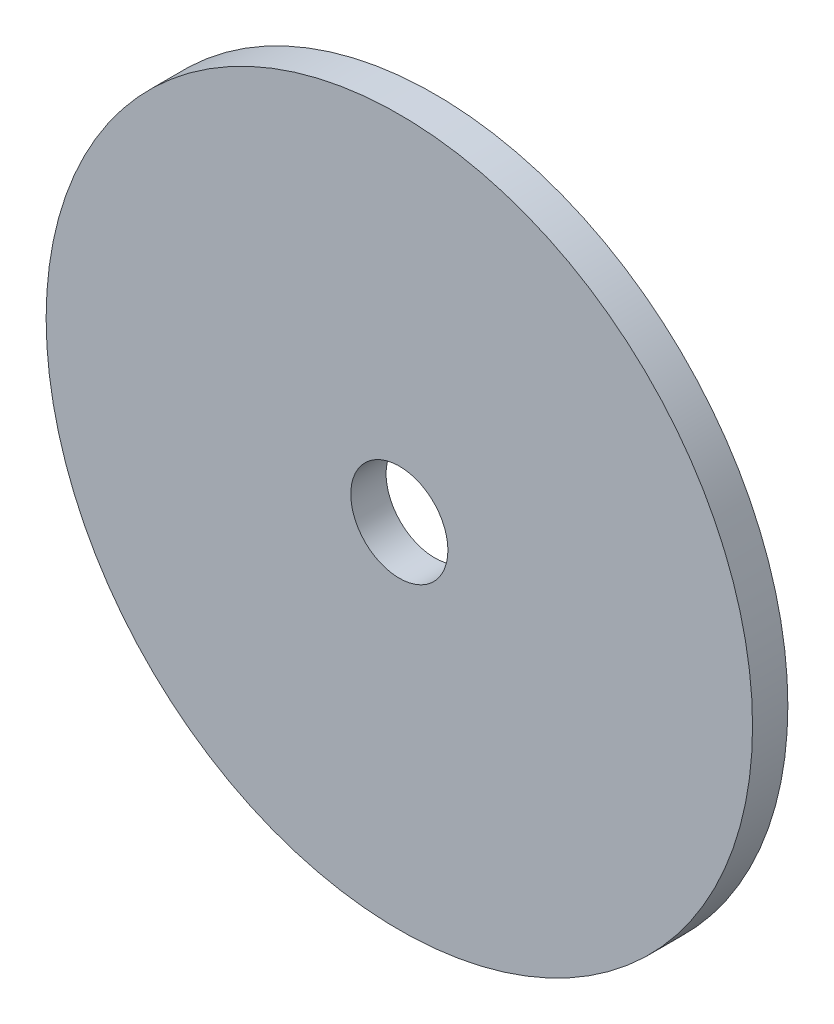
ISO-10303-21;
HEADER;
FILE_DESCRIPTION(('STEP AP214'),'2;1');
FILE_NAME('part.step','',(''),(''),'','','');
FILE_SCHEMA(('AUTOMOTIVE_DESIGN { 1 0 10303 214 1 1 1 1 }'));
ENDSEC;
DATA;
#1=APPLICATION_CONTEXT('core data for automotive mechanical design processes');
#2=APPLICATION_PROTOCOL_DEFINITION('international standard','automotive_design',2000,#1);
#3=PRODUCT_CONTEXT('',#1,'mechanical');
#4=PRODUCT('Part','Part','',(#3));
#5=PRODUCT_RELATED_PRODUCT_CATEGORY('part','',(#4));
#6=PRODUCT_DEFINITION_FORMATION('','',#4);
#7=PRODUCT_DEFINITION_CONTEXT('part definition',#1,'design');
#8=PRODUCT_DEFINITION('design','',#6,#7);
#9=PRODUCT_DEFINITION_SHAPE('','',#8);
#10=(LENGTH_UNIT() NAMED_UNIT(*) SI_UNIT(.MILLI.,.METRE.));
#11=(NAMED_UNIT(*) PLANE_ANGLE_UNIT() SI_UNIT($,.RADIAN.));
#12=(NAMED_UNIT(*) SI_UNIT($,.STERADIAN.) SOLID_ANGLE_UNIT());
#13=UNCERTAINTY_MEASURE_WITH_UNIT(LENGTH_MEASURE(1.E-05),#10,'distance_accuracy_value','');
#14=(GEOMETRIC_REPRESENTATION_CONTEXT(3) GLOBAL_UNCERTAINTY_ASSIGNED_CONTEXT((#13)) GLOBAL_UNIT_ASSIGNED_CONTEXT((#10,
#11,#12)) REPRESENTATION_CONTEXT('',''));
#15=CARTESIAN_POINT('',(0.,0.,0.));
#16=DIRECTION('',(0.,0.,1.));
#17=DIRECTION('',(1.,0.,0.));
#18=AXIS2_PLACEMENT_3D('',#15,#16,#17);
#19=CARTESIAN_POINT('',(0.,0.,2.54));
#20=DIRECTION('',(0.,0.,1.));
#21=DIRECTION('',(1.,0.,0.));
#22=AXIS2_PLACEMENT_3D('',#19,#20,#21);
#23=PLANE('',#22);
#24=CARTESIAN_POINT('',(0.,0.,2.54));
#25=DIRECTION('',(0.,0.,1.));
#26=DIRECTION('',(1.,0.,0.));
#27=AXIS2_PLACEMENT_3D('',#24,#25,#26);
#28=CIRCLE('',#27,25.4);
#29=CARTESIAN_POINT('',(25.4,0.,2.54));
#30=VERTEX_POINT('',#29);
#31=EDGE_CURVE('E10',#30,#30,#28,.T.);
#32=ORIENTED_EDGE('',*,*,#31,.T.);
#33=EDGE_LOOP('',(#32));
#34=FACE_BOUND('',#33,.T.);
#35=CARTESIAN_POINT('',(0.,0.,2.54));
#36=DIRECTION('',(0.,0.,1.));
#37=DIRECTION('',(1.,0.,0.));
#38=AXIS2_PLACEMENT_3D('',#35,#36,#37);
#39=CIRCLE('',#38,3.4925);
#40=CARTESIAN_POINT('',(3.4925,0.,2.54));
#41=VERTEX_POINT('',#40);
#42=EDGE_CURVE('E43',#41,#41,#39,.T.);
#43=ORIENTED_EDGE('',*,*,#42,.F.);
#44=EDGE_LOOP('',(#43));
#45=FACE_BOUND('',#44,.T.);
#46=ADVANCED_FACE('F32',(#34,#45),#23,.T.);
#47=CARTESIAN_POINT('',(0.,0.,0.));
#48=DIRECTION('',(0.,0.,1.));
#49=DIRECTION('',(1.,0.,0.));
#50=AXIS2_PLACEMENT_3D('',#47,#48,#49);
#51=PLANE('',#50);
#52=CARTESIAN_POINT('',(0.,0.,0.));
#53=DIRECTION('',(0.,0.,1.));
#54=DIRECTION('',(1.,0.,0.));
#55=AXIS2_PLACEMENT_3D('',#52,#53,#54);
#56=CIRCLE('',#55,25.4);
#57=CARTESIAN_POINT('',(25.4,0.,0.));
#58=VERTEX_POINT('',#57);
#59=EDGE_CURVE('E36',#58,#58,#56,.T.);
#60=ORIENTED_EDGE('',*,*,#59,.F.);
#61=EDGE_LOOP('',(#60));
#62=FACE_BOUND('',#61,.T.);
#63=CARTESIAN_POINT('',(0.,0.,0.));
#64=DIRECTION('',(0.,0.,1.));
#65=DIRECTION('',(1.,0.,0.));
#66=AXIS2_PLACEMENT_3D('',#63,#64,#65);
#67=CIRCLE('',#66,3.4925);
#68=CARTESIAN_POINT('',(3.4925,0.,0.));
#69=VERTEX_POINT('',#68);
#70=EDGE_CURVE('E45',#69,#69,#67,.T.);
#71=ORIENTED_EDGE('',*,*,#70,.T.);
#72=EDGE_LOOP('',(#71));
#73=FACE_BOUND('',#72,.T.);
#74=ADVANCED_FACE('F55',(#62,#73),#51,.F.);
#75=CARTESIAN_POINT('',(0.,0.,2.54));
#76=DIRECTION('',(0.,0.,-1.));
#77=DIRECTION('',(-1.,0.,0.));
#78=AXIS2_PLACEMENT_3D('',#75,#76,#77);
#79=CYLINDRICAL_SURFACE('',#78,25.4);
#80=ORIENTED_EDGE('',*,*,#31,.F.);
#81=EDGE_LOOP('',(#80));
#82=FACE_BOUND('',#81,.T.);
#83=ORIENTED_EDGE('',*,*,#59,.T.);
#84=EDGE_LOOP('',(#83));
#85=FACE_BOUND('',#84,.T.);
#86=ADVANCED_FACE('F34',(#82,#85),#79,.T.);
#87=CARTESIAN_POINT('',(0.,0.,2.54));
#88=DIRECTION('',(0.,0.,-1.));
#89=DIRECTION('',(-1.,0.,0.));
#90=AXIS2_PLACEMENT_3D('',#87,#88,#89);
#91=CYLINDRICAL_SURFACE('',#90,3.4925);
#92=ORIENTED_EDGE('',*,*,#42,.T.);
#93=EDGE_LOOP('',(#92));
#94=FACE_BOUND('',#93,.T.);
#95=ORIENTED_EDGE('',*,*,#70,.F.);
#96=EDGE_LOOP('',(#95));
#97=FACE_BOUND('',#96,.T.);
#98=ADVANCED_FACE('F51',(#94,#97),#91,.F.);
#99=CLOSED_SHELL('',(#46,#74,#86,#98));
#100=MANIFOLD_SOLID_BREP('B2',#99);
#101=ADVANCED_BREP_SHAPE_REPRESENTATION('',(#18,#100),#14);
#102=SHAPE_DEFINITION_REPRESENTATION(#9,#101);
ENDSEC;
END-ISO-10303-21;
